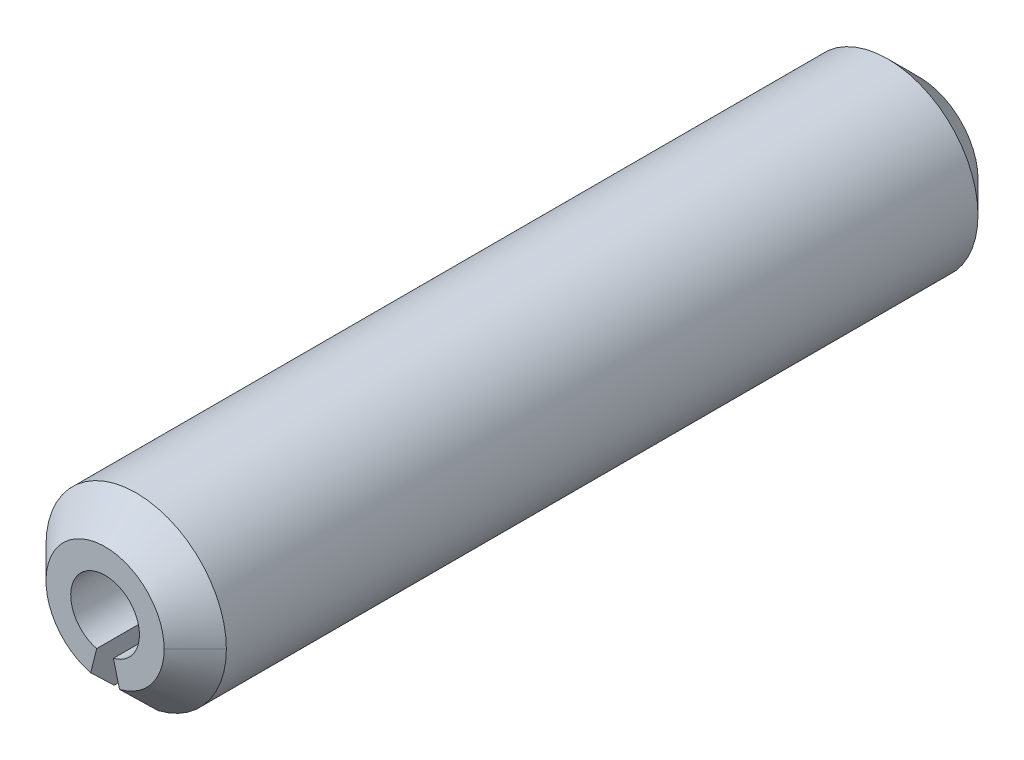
ISO-10303-21;
HEADER;
FILE_DESCRIPTION(('STEP AP214'),'2;1');
FILE_NAME('part.step','',(''),(''),'','','');
FILE_SCHEMA(('AUTOMOTIVE_DESIGN { 1 0 10303 214 1 1 1 1 }'));
ENDSEC;
DATA;
#1=APPLICATION_CONTEXT('core data for automotive mechanical design processes');
#2=APPLICATION_PROTOCOL_DEFINITION('international standard','automotive_design',2000,#1);
#3=PRODUCT_CONTEXT('',#1,'mechanical');
#4=PRODUCT('Part','Part','',(#3));
#5=PRODUCT_RELATED_PRODUCT_CATEGORY('part','',(#4));
#6=PRODUCT_DEFINITION_FORMATION('','',#4);
#7=PRODUCT_DEFINITION_CONTEXT('part definition',#1,'design');
#8=PRODUCT_DEFINITION('design','',#6,#7);
#9=PRODUCT_DEFINITION_SHAPE('','',#8);
#10=(LENGTH_UNIT() NAMED_UNIT(*) SI_UNIT(.MILLI.,.METRE.));
#11=(NAMED_UNIT(*) PLANE_ANGLE_UNIT() SI_UNIT($,.RADIAN.));
#12=(NAMED_UNIT(*) SI_UNIT($,.STERADIAN.) SOLID_ANGLE_UNIT());
#13=UNCERTAINTY_MEASURE_WITH_UNIT(LENGTH_MEASURE(1.E-05),#10,'distance_accuracy_value','');
#14=(GEOMETRIC_REPRESENTATION_CONTEXT(3) GLOBAL_UNCERTAINTY_ASSIGNED_CONTEXT((#13)) GLOBAL_UNIT_ASSIGNED_CONTEXT((#10,
#11,#12)) REPRESENTATION_CONTEXT('',''));
#15=CARTESIAN_POINT('',(0.,0.,0.));
#16=DIRECTION('',(0.,0.,1.));
#17=DIRECTION('',(1.,0.,0.));
#18=AXIS2_PLACEMENT_3D('',#15,#16,#17);
#19=CARTESIAN_POINT('',(0.,0.,0.));
#20=DIRECTION('',(0.,0.,1.));
#21=DIRECTION('',(1.,0.,0.));
#22=AXIS2_PLACEMENT_3D('',#19,#20,#21);
#23=CYLINDRICAL_SURFACE('',#22,0.396875);
#24=CARTESIAN_POINT('',(0.,0.,-9.398));
#25=DIRECTION('',(0.,0.,1.));
#26=DIRECTION('',(1.,0.,0.));
#27=AXIS2_PLACEMENT_3D('',#24,#25,#26);
#28=CIRCLE('',#27,0.396875);
#29=CARTESIAN_POINT('',(-0.0967987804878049,-0.384889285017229,-9.398));
#30=VERTEX_POINT('',#29);
#31=CARTESIAN_POINT('',(0.0967987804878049,-0.384889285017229,-9.39799999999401));
#32=VERTEX_POINT('',#31);
#33=EDGE_CURVE('E73',#30,#32,#28,.F.);
#34=ORIENTED_EDGE('',*,*,#33,.T.);
#35=DIRECTION('',(0.,0.,1.));
#36=VECTOR('',#35,1.);
#37=CARTESIAN_POINT('',(0.0967987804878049,-0.384889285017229,-9.398));
#38=LINE('',#37,#36);
#39=CARTESIAN_POINT('',(0.0967987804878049,-0.384889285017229,0.));
#40=VERTEX_POINT('',#39);
#41=EDGE_CURVE('E77',#32,#40,#38,.T.);
#42=ORIENTED_EDGE('',*,*,#41,.T.);
#43=CARTESIAN_POINT('',(0.,0.,0.));
#44=DIRECTION('',(0.,0.,1.));
#45=DIRECTION('',(1.,0.,0.));
#46=AXIS2_PLACEMENT_3D('',#43,#44,#45);
#47=CIRCLE('',#46,0.396875);
#48=CARTESIAN_POINT('',(-0.0967987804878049,-0.384889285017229,0.));
#49=VERTEX_POINT('',#48);
#50=EDGE_CURVE('E121',#40,#49,#47,.T.);
#51=ORIENTED_EDGE('',*,*,#50,.T.);
#52=DIRECTION('',(0.,0.,1.));
#53=VECTOR('',#52,1.);
#54=CARTESIAN_POINT('',(-0.0967987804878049,-0.384889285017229,-9.398));
#55=LINE('',#54,#53);
#56=EDGE_CURVE('E80',#49,#30,#55,.F.);
#57=ORIENTED_EDGE('',*,*,#56,.T.);
#58=EDGE_LOOP('',(#34,#42,#51,#57));
#59=FACE_BOUND('',#58,.T.);
#60=ADVANCED_FACE('F18',(#59),#23,.F.);
#61=CARTESIAN_POINT('',(0.,0.682189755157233,-9.398));
#62=DIRECTION('',(0.,0.,1.));
#63=DIRECTION('',(1.,0.,0.));
#64=AXIS2_PLACEMENT_3D('',#61,#62,#63);
#65=PLANE('',#64);
#66=DIRECTION('',(-0.24390243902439,-0.969799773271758,0.));
#67=VECTOR('',#66,1.);
#68=CARTESIAN_POINT('',(-0.254,-1.00994948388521,-9.398));
#69=LINE('',#68,#67);
#70=CARTESIAN_POINT('',(-0.166387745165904,-0.661587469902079,-9.39799999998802));
#71=VERTEX_POINT('',#70);
#72=EDGE_CURVE('E84',#30,#71,#69,.T.);
#73=ORIENTED_EDGE('',*,*,#72,.T.);
#74=CARTESIAN_POINT('',(0.,0.,-9.39799999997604));
#75=DIRECTION('',(0.,0.,1.));
#76=DIRECTION('',(1.,0.,0.));
#77=AXIS2_PLACEMENT_3D('',#74,#75,#76);
#78=CIRCLE('',#77,0.68218975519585);
#79=CARTESIAN_POINT('',(0.166387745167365,-0.661587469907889,-9.39799999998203));
#80=VERTEX_POINT('',#79);
#81=EDGE_CURVE('E89',#80,#71,#78,.T.);
#82=ORIENTED_EDGE('',*,*,#81,.F.);
#83=DIRECTION('',(-0.24390243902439,0.969799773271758,0.));
#84=VECTOR('',#83,1.);
#85=CARTESIAN_POINT('',(0.,0.,-9.39799999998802));
#86=LINE('',#85,#84);
#87=EDGE_CURVE('E87',#80,#32,#86,.T.);
#88=ORIENTED_EDGE('',*,*,#87,.T.);
#89=ORIENTED_EDGE('',*,*,#33,.F.);
#90=EDGE_LOOP('',(#73,#82,#88,#89));
#91=FACE_BOUND('',#90,.T.);
#92=ADVANCED_FACE('F88',(#91),#65,.F.);
#93=CARTESIAN_POINT('',(-0.254,-1.00994948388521,-9.398));
#94=DIRECTION('',(-0.969799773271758,0.24390243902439,0.));
#95=DIRECTION('',(-0.24390243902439,-0.969799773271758,0.));
#96=AXIS2_PLACEMENT_3D('',#93,#94,#95);
#97=PLANE('',#96);
#98=DIRECTION('',(-0.243902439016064,-0.969799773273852,0.));
#99=VECTOR('',#98,1.);
#100=CARTESIAN_POINT('',(-0.0967987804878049,-0.384889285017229,0.));
#101=LINE('',#100,#99);
#102=CARTESIAN_POINT('',(-0.166387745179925,-0.661587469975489,1.42108627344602E-11));
#103=VERTEX_POINT('',#102);
#104=EDGE_CURVE('E119',#49,#103,#101,.T.);
#105=ORIENTED_EDGE('',*,*,#104,.T.);
#106=DIRECTION('',(0.172465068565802,0.685751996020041,0.707106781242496));
#107=VECTOR('',#106,1.);
#108=CARTESIAN_POINT('',(-121707.31707131,-483930.086863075,-498999.317889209));
#109=LINE('',#108,#107);
#110=CARTESIAN_POINT('',(-0.253999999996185,-1.00994948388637,-0.359210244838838));
#111=VERTEX_POINT('',#110);
#112=EDGE_CURVE('E116',#111,#103,#109,.T.);
#113=ORIENTED_EDGE('',*,*,#112,.F.);
#114=DIRECTION('',(0.,0.,1.));
#115=VECTOR('',#114,1.);
#116=CARTESIAN_POINT('',(-0.254,-1.00994948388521,0.));
#117=LINE('',#116,#115);
#118=CARTESIAN_POINT('',(-0.254000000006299,-1.009949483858,-9.03878975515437));
#119=VERTEX_POINT('',#118);
#120=EDGE_CURVE('E129',#119,#111,#117,.T.);
#121=ORIENTED_EDGE('',*,*,#120,.F.);
#122=DIRECTION('',(-0.172465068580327,-0.685751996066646,0.707106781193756));
#123=VECTOR('',#122,1.);
#124=CARTESIAN_POINT('',(-0.16638774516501,-0.661587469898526,-9.39799999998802));
#125=LINE('',#124,#123);
#126=EDGE_CURVE('E122',#71,#119,#125,.T.);
#127=ORIENTED_EDGE('',*,*,#126,.F.);
#128=ORIENTED_EDGE('',*,*,#72,.F.);
#129=ORIENTED_EDGE('',*,*,#56,.F.);
#130=EDGE_LOOP('',(#105,#113,#121,#127,#128,#129));
#131=FACE_BOUND('',#130,.T.);
#132=ADVANCED_FACE('F144',(#131),#97,.F.);
#133=CARTESIAN_POINT('',(0.,0.682189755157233,0.));
#134=DIRECTION('',(0.,0.,-1.));
#135=DIRECTION('',(-1.,0.,0.));
#136=AXIS2_PLACEMENT_3D('',#133,#134,#135);
#137=PLANE('',#136);
#138=ORIENTED_EDGE('',*,*,#104,.F.);
#139=ORIENTED_EDGE('',*,*,#50,.F.);
#140=DIRECTION('',(-0.24390243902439,0.969799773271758,0.));
#141=VECTOR('',#140,1.);
#142=CARTESIAN_POINT('',(0.,0.,0.));
#143=LINE('',#142,#141);
#144=CARTESIAN_POINT('',(0.166387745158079,-0.661587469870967,5.6843418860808E-11));
#145=VERTEX_POINT('',#144);
#146=EDGE_CURVE('E98',#40,#145,#143,.F.);
#147=ORIENTED_EDGE('',*,*,#146,.T.);
#148=CARTESIAN_POINT('',(0.,0.,5.6843418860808E-11));
#149=DIRECTION('',(0.,0.,-1.));
#150=DIRECTION('',(-1.,0.,0.));
#151=AXIS2_PLACEMENT_3D('',#148,#149,#150);
#152=CIRCLE('',#151,0.68218975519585);
#153=CARTESIAN_POINT('',(0.68218975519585,0.,5.6843418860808E-11));
#154=VERTEX_POINT('',#153);
#155=EDGE_CURVE('E108',#154,#145,#152,.T.);
#156=ORIENTED_EDGE('',*,*,#155,.F.);
#157=CARTESIAN_POINT('',(0.,0.,5.6843418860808E-11));
#158=DIRECTION('',(0.,0.,-1.));
#159=DIRECTION('',(-1.,0.,0.));
#160=AXIS2_PLACEMENT_3D('',#157,#158,#159);
#161=CIRCLE('',#160,0.68218975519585);
#162=EDGE_CURVE('E126',#103,#154,#161,.T.);
#163=ORIENTED_EDGE('',*,*,#162,.F.);
#164=EDGE_LOOP('',(#138,#139,#147,#156,#163));
#165=FACE_BOUND('',#164,.T.);
#166=ADVANCED_FACE('F152',(#165),#137,.F.);
#167=CARTESIAN_POINT('',(0.,0.,-0.359210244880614));
#168=DIRECTION('',(0.,0.,-1.));
#169=DIRECTION('',(-1.,0.,0.));
#170=AXIS2_PLACEMENT_3D('',#167,#168,#169);
#171=CONICAL_SURFACE('',#170,1.04140000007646,0.785398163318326);
#172=DIRECTION('',(0.172465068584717,-0.685751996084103,-0.707106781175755));
#173=VECTOR('',#172,1.);
#174=CARTESIAN_POINT('',(0.166387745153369,-0.66158746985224,2.84269136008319E-11));
#175=LINE('',#174,#173);
#176=CARTESIAN_POINT('',(0.254000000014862,-1.00994948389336,-0.359210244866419));
#177=VERTEX_POINT('',#176);
#178=EDGE_CURVE('E100',#145,#177,#175,.T.);
#179=ORIENTED_EDGE('',*,*,#178,.T.);
#180=CARTESIAN_POINT('',(0.,0.,-0.359210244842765));
#181=DIRECTION('',(0.,0.,1.));
#182=DIRECTION('',(1.,0.,0.));
#183=AXIS2_PLACEMENT_3D('',#180,#181,#182);
#184=CIRCLE('',#183,1.0414);
#185=CARTESIAN_POINT('',(1.04140000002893,0.,-0.359210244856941));
#186=VERTEX_POINT('',#185);
#187=EDGE_CURVE('E36',#186,#177,#184,.F.);
#188=ORIENTED_EDGE('',*,*,#187,.F.);
#189=DIRECTION('',(-0.707106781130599,0.,0.707106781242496));
#190=VECTOR('',#189,1.);
#191=CARTESIAN_POINT('',(499000.,6.11098752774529E-11,-498999.317889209));
#192=LINE('',#191,#190);
#193=EDGE_CURVE('E103',#154,#186,#192,.F.);
#194=ORIENTED_EDGE('',*,*,#193,.F.);
#195=ORIENTED_EDGE('',*,*,#155,.T.);
#196=EDGE_LOOP('',(#179,#188,#194,#195));
#197=FACE_BOUND('',#196,.T.);
#198=ADVANCED_FACE('F151',(#197),#171,.T.);
#199=CARTESIAN_POINT('',(0.,0.,-9.398));
#200=DIRECTION('',(0.969799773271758,0.24390243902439,0.));
#201=DIRECTION('',(-0.24390243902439,0.969799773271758,0.));
#202=AXIS2_PLACEMENT_3D('',#199,#200,#201);
#203=PLANE('',#202);
#204=ORIENTED_EDGE('',*,*,#146,.F.);
#205=ORIENTED_EDGE('',*,*,#41,.F.);
#206=ORIENTED_EDGE('',*,*,#87,.F.);
#207=DIRECTION('',(-0.172465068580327,0.685751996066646,-0.707106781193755));
#208=VECTOR('',#207,1.);
#209=CARTESIAN_POINT('',(0.254000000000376,-1.0099494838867,-9.0387897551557));
#210=LINE('',#209,#208);
#211=CARTESIAN_POINT('',(0.253999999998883,-1.00994948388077,-9.03878975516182));
#212=VERTEX_POINT('',#211);
#213=EDGE_CURVE('E93',#212,#80,#210,.T.);
#214=ORIENTED_EDGE('',*,*,#213,.F.);
#215=DIRECTION('',(0.,0.,1.));
#216=VECTOR('',#215,1.);
#217=CARTESIAN_POINT('',(0.253999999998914,-1.00994948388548,0.));
#218=LINE('',#217,#216);
#219=EDGE_CURVE('E111',#177,#212,#218,.F.);
#220=ORIENTED_EDGE('',*,*,#219,.F.);
#221=ORIENTED_EDGE('',*,*,#178,.F.);
#222=EDGE_LOOP('',(#204,#205,#206,#214,#220,#221));
#223=FACE_BOUND('',#222,.T.);
#224=ADVANCED_FACE('F96',(#223),#203,.F.);
#225=CARTESIAN_POINT('',(0.,0.,-9.03878975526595));
#226=DIRECTION('',(0.,0.,1.));
#227=DIRECTION('',(1.,0.,0.));
#228=AXIS2_PLACEMENT_3D('',#225,#226,#227);
#229=CONICAL_SURFACE('',#228,1.04139999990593,0.785398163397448);
#230=CARTESIAN_POINT('',(0.,0.,-9.03878975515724));
#231=DIRECTION('',(0.,0.,1.));
#232=DIRECTION('',(1.,0.,0.));
#233=AXIS2_PLACEMENT_3D('',#230,#231,#232);
#234=CIRCLE('',#233,1.0414);
#235=EDGE_CURVE('E27',#212,#119,#234,.T.);
#236=ORIENTED_EDGE('',*,*,#235,.F.);
#237=ORIENTED_EDGE('',*,*,#213,.T.);
#238=ORIENTED_EDGE('',*,*,#81,.T.);
#239=ORIENTED_EDGE('',*,*,#126,.T.);
#240=EDGE_LOOP('',(#236,#237,#238,#239));
#241=FACE_BOUND('',#240,.T.);
#242=ADVANCED_FACE('F140',(#241),#229,.T.);
#243=CARTESIAN_POINT('',(0.,0.,-0.359210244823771));
#244=DIRECTION('',(0.,0.,-1.));
#245=DIRECTION('',(-1.,0.,0.));
#246=AXIS2_PLACEMENT_3D('',#243,#244,#245);
#247=CONICAL_SURFACE('',#246,1.04139999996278,0.785398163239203);
#248=CARTESIAN_POINT('',(0.,0.,-0.359210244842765));
#249=DIRECTION('',(0.,0.,1.));
#250=DIRECTION('',(1.,0.,0.));
#251=AXIS2_PLACEMENT_3D('',#248,#249,#250);
#252=CIRCLE('',#251,1.0414);
#253=EDGE_CURVE('E11',#111,#186,#252,.F.);
#254=ORIENTED_EDGE('',*,*,#253,.F.);
#255=ORIENTED_EDGE('',*,*,#112,.T.);
#256=ORIENTED_EDGE('',*,*,#162,.T.);
#257=ORIENTED_EDGE('',*,*,#193,.T.);
#258=EDGE_LOOP('',(#254,#255,#256,#257));
#259=FACE_BOUND('',#258,.T.);
#260=ADVANCED_FACE('F150',(#259),#247,.T.);
#261=CARTESIAN_POINT('',(0.,0.,0.));
#262=DIRECTION('',(0.,0.,1.));
#263=DIRECTION('',(1.,0.,0.));
#264=AXIS2_PLACEMENT_3D('',#261,#262,#263);
#265=CYLINDRICAL_SURFACE('',#264,1.0414);
#266=ORIENTED_EDGE('',*,*,#253,.T.);
#267=ORIENTED_EDGE('',*,*,#187,.T.);
#268=ORIENTED_EDGE('',*,*,#219,.T.);
#269=ORIENTED_EDGE('',*,*,#235,.T.);
#270=ORIENTED_EDGE('',*,*,#120,.T.);
#271=EDGE_LOOP('',(#266,#267,#268,#269,#270));
#272=FACE_BOUND('',#271,.T.);
#273=ADVANCED_FACE('F135',(#272),#265,.T.);
#274=CLOSED_SHELL('',(#60,#92,#132,#166,#198,#224,#242,#260,#273));
#275=MANIFOLD_SOLID_BREP('B1',#274);
#276=ADVANCED_BREP_SHAPE_REPRESENTATION('',(#18,#275),#14);
#277=SHAPE_DEFINITION_REPRESENTATION(#9,#276);
ENDSEC;
END-ISO-10303-21;
